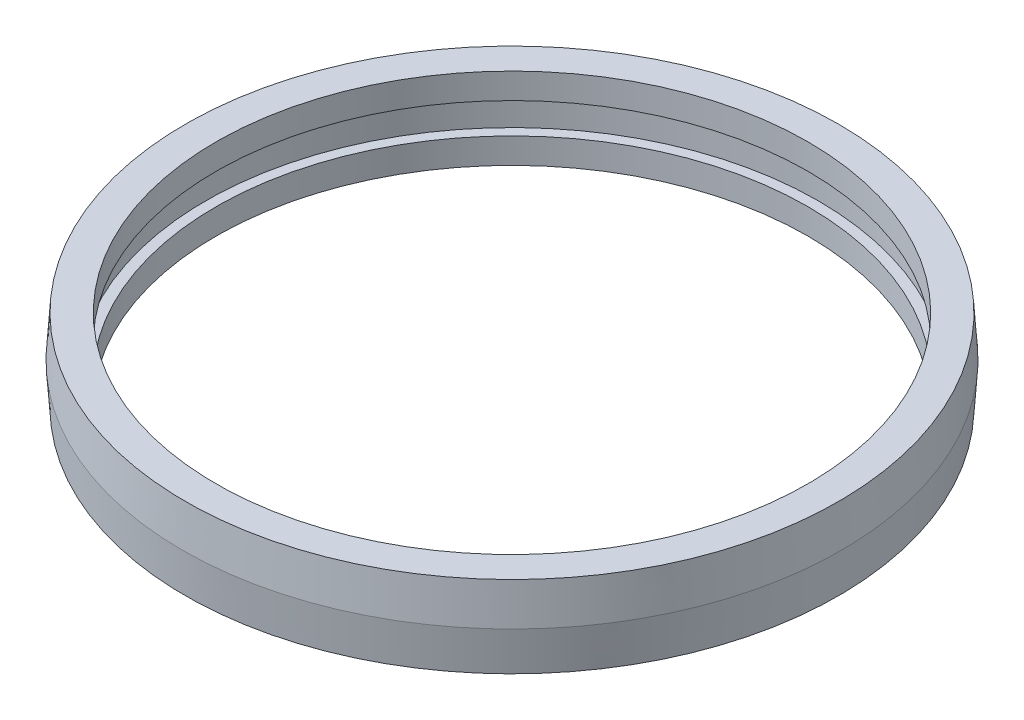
from build123d import *


with BuildPart() as part:
    # Sketch3 → Revolve1 (revolve)
    with BuildSketch(Plane.XY, mode=Mode.PRIVATE) as revolve1_sk:
        Polygon((-92.075, -4.7625), (-95.25, -4.7625), (-95.25, 4.7625), (-92.075, 4.7625), (-92.075, 12.7), (-101.6, 12.7), (-102.488070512, 0), (-101.6, -12.7), (-92.075, -12.7), align=None)
    revolve(revolve1_sk.sketch.rotate(Axis((0, 0, 0), (0, 1, 0)), 270), axis=Axis((0, 0, 0), (0, 1, 0)))


solid = part.part
